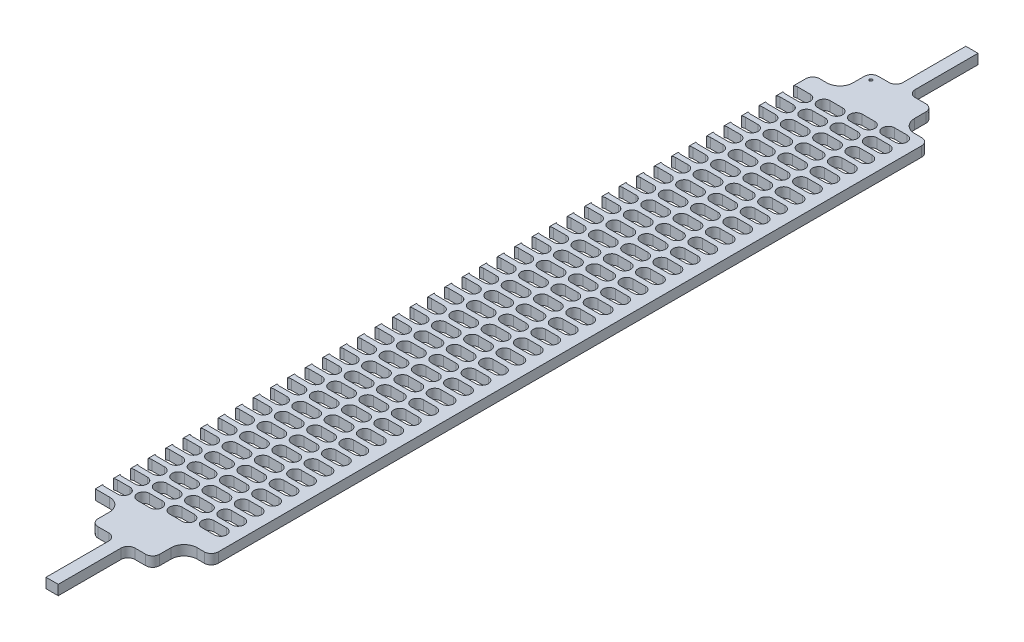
from build123d import *

# Parameters (mm, degrees)
SALIENTE_EXTRUIR1_DEPTH = 5.7
REDONDEO1_R             = 7.5
REDONDEO2_R             = 4
CROQUIS2_R              = 0.851014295
CORTAR_EXTRUIR1_DEPTH   = 1


with BuildPart() as part:
    # Croquis1 → Saliente-Extruir1 (new body)
    with BuildSketch(Plane(origin=(0, 0, 0), x_dir=(1, 0, 0), z_dir=(0, 1, 0))):
        with BuildLine():
            Line((15.6, 411.2), (15.6, 429.2))
            Line((15.6, 429.2), (29.75, 429.2))
            Line((29.75, 429.2), (29.75, 469.2))
            Line((29.75, 469.2), (36.75, 469.2))
            Line((36.75, 469.2), (36.75, 429.2))
            Line((36.75, 429.2), (50.9, 429.2))
            Line((50.9, 429.2), (50.9, 411.2))
            Line((50.9, 411.2), (66.5, 411.2))
            Line((66.5, 411.2), (66.5, 0))
            Line((66.5, 0), (50.9, 0))
            Line((50.9, 0), (50.9, -18))
            Line((50.9, -18), (36.75, -18))
            Line((36.75, -18), (36.75, -58))
            Line((36.75, -58), (29.75, -58))
            Line((29.75, -58), (29.75, -18))
            Line((29.75, -18), (15.6, -18))
            Line((15.6, -18), (15.6, 0))
            Line((15.6, 0), (0, 0))
            Line((0, 0), (0, 4.298333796))
            ThreePointArc((0, 4.298333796), (0.866145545, 3.926883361), (1.8, 3.8))
            Line((1.8, 3.8), (9, 3.8))
            ThreePointArc((9, 3.8), (12.5, 7.3), (9, 10.8))
            Line((9, 10.8), (1.8, 10.8))
            ThreePointArc((1.8, 10.8), (0.866145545, 10.673116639), (0, 10.301666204))
            Line((0, 10.301666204), (0, 14.298333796))
            ThreePointArc((0, 14.298333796), (0.866145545, 13.926883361), (1.8, 13.8))
            Line((1.8, 13.8), (9, 13.8))
            ThreePointArc((9, 13.8), (12.5, 17.3), (9, 20.8))
            Line((9, 20.8), (1.8, 20.8))
            ThreePointArc((1.8, 20.8), (0.866145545, 20.673116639), (0, 20.301666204))
            Line((0, 20.301666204), (0, 24.298333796))
            ThreePointArc((0, 24.298333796), (0.866145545, 23.926883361), (1.8, 23.8))
            Line((1.8, 23.8), (9, 23.8))
            ThreePointArc((9, 23.8), (12.5, 27.3), (9, 30.8))
            Line((9, 30.8), (1.8, 30.8))
            ThreePointArc((1.8, 30.8), (0.866145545, 30.673116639), (0, 30.301666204))
            Line((0, 30.301666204), (0, 34.298333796))
            ThreePointArc((0, 34.298333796), (0.866145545, 33.926883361), (1.8, 33.8))
            Line((1.8, 33.8), (9, 33.8))
            ThreePointArc((9, 33.8), (12.5, 37.3), (9, 40.8))
            Line((9, 40.8), (1.8, 40.8))
            ThreePointArc((1.8, 40.8), (0.866145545, 40.673116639), (0, 40.301666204))
            Line((0, 40.301666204), (0, 44.298333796))
            ThreePointArc((0, 44.298333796), (0.866145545, 43.926883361), (1.8, 43.8))
            Line((1.8, 43.8), (9, 43.8))
            ThreePointArc((9, 43.8), (12.5, 47.3), (9, 50.8))
            Line((9, 50.8), (1.8, 50.8))
            ThreePointArc((1.8, 50.8), (0.866145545, 50.673116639), (0, 50.301666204))
            Line((0, 50.301666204), (0, 54.298333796))
            ThreePointArc((0, 54.298333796), (0.866145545, 53.926883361), (1.8, 53.8))
            Line((1.8, 53.8), (9, 53.8))
            ThreePointArc((9, 53.8), (12.5, 57.3), (9, 60.8))
            Line((9, 60.8), (1.8, 60.8))
            ThreePointArc((1.8, 60.8), (0.866145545, 60.673116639), (0, 60.301666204))
            Line((0, 60.301666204), (0, 64.298333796))
            ThreePointArc((0, 64.298333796), (0.866145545, 63.926883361), (1.8, 63.8))
            Line((1.8, 63.8), (9, 63.8))
            ThreePointArc((9, 63.8), (12.5, 67.3), (9, 70.8))
            Line((9, 70.8), (1.8, 70.8))
            ThreePointArc((1.8, 70.8), (0.866145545, 70.673116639), (0, 70.301666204))
            Line((0, 70.301666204), (0, 74.298333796))
            ThreePointArc((0, 74.298333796), (0.866145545, 73.926883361), (1.8, 73.8))
            Line((1.8, 73.8), (9, 73.8))
            ThreePointArc((9, 73.8), (12.5, 77.3), (9, 80.8))
            Line((9, 80.8), (1.8, 80.8))
            ThreePointArc((1.8, 80.8), (0.866145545, 80.673116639), (0, 80.301666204))
            Line((0, 80.301666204), (0, 84.298333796))
            ThreePointArc((0, 84.298333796), (0.866145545, 83.926883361), (1.8, 83.8))
            Line((1.8, 83.8), (9, 83.8))
            ThreePointArc((9, 83.8), (12.5, 87.3), (9, 90.8))
            Line((9, 90.8), (1.8, 90.8))
            ThreePointArc((1.8, 90.8), (0.866145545, 90.673116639), (0, 90.301666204))
            Line((0, 90.301666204), (0, 94.298333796))
            ThreePointArc((0, 94.298333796), (0.866145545, 93.926883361), (1.8, 93.8))
            Line((1.8, 93.8), (9, 93.8))
            ThreePointArc((9, 93.8), (12.5, 97.3), (9, 100.8))
            Line((9, 100.8), (1.8, 100.8))
            ThreePointArc((1.8, 100.8), (0.866145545, 100.673116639), (0, 100.301666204))
            Line((0, 100.301666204), (0, 104.298333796))
            ThreePointArc((0, 104.298333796), (0.866145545, 103.926883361), (1.8, 103.8))
            Line((1.8, 103.8), (9, 103.8))
            ThreePointArc((9, 103.8), (12.5, 107.3), (9, 110.8))
            Line((9, 110.8), (1.8, 110.8))
            ThreePointArc((1.8, 110.8), (0.866145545, 110.673116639), (0, 110.301666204))
            Line((0, 110.301666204), (0, 114.298333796))
            ThreePointArc((0, 114.298333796), (0.866145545, 113.926883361), (1.8, 113.8))
            Line((1.8, 113.8), (9, 113.8))
            ThreePointArc((9, 113.8), (12.5, 117.3), (9, 120.8))
            Line((9, 120.8), (1.8, 120.8))
            ThreePointArc((1.8, 120.8), (0.866145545, 120.673116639), (0, 120.301666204))
            Line((0, 120.301666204), (0, 124.298333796))
            ThreePointArc((0, 124.298333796), (0.866145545, 123.926883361), (1.8, 123.8))
            Line((1.8, 123.8), (9, 123.8))
            ThreePointArc((9, 123.8), (12.5, 127.3), (9, 130.8))
            Line((9, 130.8), (1.8, 130.8))
            ThreePointArc((1.8, 130.8), (0.866145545, 130.673116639), (0, 130.301666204))
            Line((0, 130.301666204), (0, 134.298333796))
            ThreePointArc((0, 134.298333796), (0.866145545, 133.926883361), (1.8, 133.8))
            Line((1.8, 133.8), (9, 133.8))
            ThreePointArc((9, 133.8), (12.5, 137.3), (9, 140.8))
            Line((9, 140.8), (1.8, 140.8))
            ThreePointArc((1.8, 140.8), (0.866145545, 140.673116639), (0, 140.301666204))
            Line((0, 140.301666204), (0, 144.298333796))
            ThreePointArc((0, 144.298333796), (0.866145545, 143.926883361), (1.8, 143.8))
            Line((1.8, 143.8), (9, 143.8))
            ThreePointArc((9, 143.8), (12.5, 147.3), (9, 150.8))
            Line((9, 150.8), (1.8, 150.8))
            ThreePointArc((1.8, 150.8), (0.866145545, 150.673116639), (0, 150.301666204))
            Line((0, 150.301666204), (0, 154.298333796))
            ThreePointArc((0, 154.298333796), (0.866145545, 153.926883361), (1.8, 153.8))
            Line((1.8, 153.8), (9, 153.8))
            ThreePointArc((9, 153.8), (12.5, 157.3), (9, 160.8))
            Line((9, 160.8), (1.8, 160.8))
            ThreePointArc((1.8, 160.8), (0.866145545, 160.673116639), (0, 160.301666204))
            Line((0, 160.301666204), (0, 164.298333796))
            ThreePointArc((0, 164.298333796), (0.866145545, 163.926883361), (1.8, 163.8))
            Line((1.8, 163.8), (9, 163.8))
            ThreePointArc((9, 163.8), (12.5, 167.3), (9, 170.8))
            Line((9, 170.8), (1.8, 170.8))
            ThreePointArc((1.8, 170.8), (0.866145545, 170.673116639), (0, 170.301666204))
            Line((0, 170.301666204), (0, 174.298333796))
            ThreePointArc((0, 174.298333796), (0.866145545, 173.926883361), (1.8, 173.8))
            Line((1.8, 173.8), (9, 173.8))
            ThreePointArc((9, 173.8), (12.5, 177.3), (9, 180.8))
            Line((9, 180.8), (1.8, 180.8))
            ThreePointArc((1.8, 180.8), (0.866145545, 180.673116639), (0, 180.301666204))
            Line((0, 180.301666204), (0, 184.298333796))
            ThreePointArc((0, 184.298333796), (0.866145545, 183.926883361), (1.8, 183.8))
            Line((1.8, 183.8), (9, 183.8))
            ThreePointArc((9, 183.8), (12.5, 187.3), (9, 190.8))
            Line((9, 190.8), (1.8, 190.8))
            ThreePointArc((1.8, 190.8), (0.866145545, 190.673116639), (0, 190.301666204))
            Line((0, 190.301666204), (0, 194.298333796))
            ThreePointArc((0, 194.298333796), (0.866145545, 193.926883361), (1.8, 193.8))
            Line((1.8, 193.8), (9, 193.8))
            ThreePointArc((9, 193.8), (12.5, 197.3), (9, 200.8))
            Line((9, 200.8), (1.8, 200.8))
            ThreePointArc((1.8, 200.8), (0.866145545, 200.673116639), (0, 200.301666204))
            Line((0, 200.301666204), (0, 204.298333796))
            ThreePointArc((0, 204.298333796), (0.866145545, 203.926883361), (1.8, 203.8))
            Line((1.8, 203.8), (9, 203.8))
            ThreePointArc((9, 203.8), (12.5, 207.3), (9, 210.8))
            Line((9, 210.8), (1.8, 210.8))
            ThreePointArc((1.8, 210.8), (0.866145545, 210.673116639), (0, 210.301666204))
            Line((0, 210.301666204), (0, 214.298333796))
            ThreePointArc((0, 214.298333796), (0.866145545, 213.926883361), (1.8, 213.8))
            Line((1.8, 213.8), (9, 213.8))
            ThreePointArc((9, 213.8), (12.5, 217.3), (9, 220.8))
            Line((9, 220.8), (1.8, 220.8))
            ThreePointArc((1.8, 220.8), (0.866145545, 220.673116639), (0, 220.301666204))
            Line((0, 220.301666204), (0, 224.298333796))
            ThreePointArc((0, 224.298333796), (0.866145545, 223.926883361), (1.8, 223.8))
            Line((1.8, 223.8), (9, 223.8))
            ThreePointArc((9, 223.8), (12.5, 227.3), (9, 230.8))
            Line((9, 230.8), (1.8, 230.8))
            ThreePointArc((1.8, 230.8), (0.866145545, 230.673116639), (0, 230.301666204))
            Line((0, 230.301666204), (0, 234.298333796))
            ThreePointArc((0, 234.298333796), (0.866145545, 233.926883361), (1.8, 233.8))
            Line((1.8, 233.8), (9, 233.8))
            ThreePointArc((9, 233.8), (12.5, 237.3), (9, 240.8))
            Line((9, 240.8), (1.8, 240.8))
            ThreePointArc((1.8, 240.8), (0.866145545, 240.673116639), (0, 240.301666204))
            Line((0, 240.301666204), (0, 244.298333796))
            ThreePointArc((0, 244.298333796), (0.866145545, 243.926883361), (1.8, 243.8))
            Line((1.8, 243.8), (9, 243.8))
            ThreePointArc((9, 243.8), (12.5, 247.3), (9, 250.8))
            Line((9, 250.8), (1.8, 250.8))
            ThreePointArc((1.8, 250.8), (0.866145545, 250.673116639), (0, 250.301666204))
            Line((0, 250.301666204), (0, 254.298333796))
            ThreePointArc((0, 254.298333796), (0.866145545, 253.926883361), (1.8, 253.8))
            Line((1.8, 253.8), (9, 253.8))
            ThreePointArc((9, 253.8), (12.5, 257.3), (9, 260.8))
            Line((9, 260.8), (1.8, 260.8))
            ThreePointArc((1.8, 260.8), (0.866145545, 260.673116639), (0, 260.301666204))
            Line((0, 260.301666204), (0, 264.298333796))
            ThreePointArc((0, 264.298333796), (0.866145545, 263.926883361), (1.8, 263.8))
            Line((1.8, 263.8), (9, 263.8))
            ThreePointArc((9, 263.8), (12.5, 267.3), (9, 270.8))
            Line((9, 270.8), (1.8, 270.8))
            ThreePointArc((1.8, 270.8), (0.866145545, 270.673116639), (0, 270.301666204))
            Line((0, 270.301666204), (0, 274.298333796))
            ThreePointArc((0, 274.298333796), (0.866145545, 273.926883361), (1.8, 273.8))
            Line((1.8, 273.8), (9, 273.8))
            ThreePointArc((9, 273.8), (12.5, 277.3), (9, 280.8))
            Line((9, 280.8), (1.8, 280.8))
            ThreePointArc((1.8, 280.8), (0.866145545, 280.673116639), (0, 280.301666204))
            Line((0, 280.301666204), (0, 284.298333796))
            ThreePointArc((0, 284.298333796), (0.866145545, 283.926883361), (1.8, 283.8))
            Line((1.8, 283.8), (9, 283.8))
            ThreePointArc((9, 283.8), (12.5, 287.3), (9, 290.8))
            Line((9, 290.8), (1.8, 290.8))
            ThreePointArc((1.8, 290.8), (0.866145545, 290.673116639), (0, 290.301666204))
            Line((0, 290.301666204), (0, 294.298333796))
            ThreePointArc((0, 294.298333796), (0.866145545, 293.926883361), (1.8, 293.8))
            Line((1.8, 293.8), (9, 293.8))
            ThreePointArc((9, 293.8), (12.5, 297.3), (9, 300.8))
            Line((9, 300.8), (1.8, 300.8))
            ThreePointArc((1.8, 300.8), (0.866145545, 300.673116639), (0, 300.301666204))
            Line((0, 300.301666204), (0, 304.298333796))
            ThreePointArc((0, 304.298333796), (0.866145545, 303.926883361), (1.8, 303.8))
            Line((1.8, 303.8), (9, 303.8))
            ThreePointArc((9, 303.8), (12.5, 307.3), (9, 310.8))
            Line((9, 310.8), (1.8, 310.8))
            ThreePointArc((1.8, 310.8), (0.866145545, 310.673116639), (0, 310.301666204))
            Line((0, 310.301666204), (0, 314.298333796))
            ThreePointArc((0, 314.298333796), (0.866145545, 313.926883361), (1.8, 313.8))
            Line((1.8, 313.8), (9, 313.8))
            ThreePointArc((9, 313.8), (12.5, 317.3), (9, 320.8))
            Line((9, 320.8), (1.8, 320.8))
            ThreePointArc((1.8, 320.8), (0.866145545, 320.673116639), (0, 320.301666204))
            Line((0, 320.301666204), (0, 324.298333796))
            ThreePointArc((0, 324.298333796), (0.866145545, 323.926883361), (1.8, 323.8))
            Line((1.8, 323.8), (9, 323.8))
            ThreePointArc((9, 323.8), (12.5, 327.3), (9, 330.8))
            Line((9, 330.8), (1.8, 330.8))
            ThreePointArc((1.8, 330.8), (0.866145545, 330.673116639), (0, 330.301666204))
            Line((0, 330.301666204), (0, 334.298333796))
            ThreePointArc((0, 334.298333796), (0.866145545, 333.926883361), (1.8, 333.8))
            Line((1.8, 333.8), (9, 333.8))
            ThreePointArc((9, 333.8), (12.5, 337.3), (9, 340.8))
            Line((9, 340.8), (1.8, 340.8))
            ThreePointArc((1.8, 340.8), (0.866145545, 340.673116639), (0, 340.301666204))
            Line((0, 340.301666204), (0, 344.298333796))
            ThreePointArc((0, 344.298333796), (0.866145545, 343.926883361), (1.8, 343.8))
            Line((1.8, 343.8), (9, 343.8))
            ThreePointArc((9, 343.8), (12.5, 347.3), (9, 350.8))
            Line((9, 350.8), (1.8, 350.8))
            ThreePointArc((1.8, 350.8), (0.866145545, 350.673116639), (0, 350.301666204))
            Line((0, 350.301666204), (0, 354.298333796))
            ThreePointArc((0, 354.298333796), (0.866145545, 353.926883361), (1.8, 353.8))
            Line((1.8, 353.8), (9, 353.8))
            ThreePointArc((9, 353.8), (12.5, 357.3), (9, 360.8))
            Line((9, 360.8), (1.8, 360.8))
            ThreePointArc((1.8, 360.8), (0.866145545, 360.673116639), (0, 360.301666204))
            Line((0, 360.301666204), (0, 364.298333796))
            ThreePointArc((0, 364.298333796), (0.866145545, 363.926883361), (1.8, 363.8))
            Line((1.8, 363.8), (9, 363.8))
            ThreePointArc((9, 363.8), (12.5, 367.3), (9, 370.8))
            Line((9, 370.8), (1.8, 370.8))
            ThreePointArc((1.8, 370.8), (0.866145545, 370.673116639), (0, 370.301666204))
            Line((0, 370.301666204), (0, 374.298333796))
            ThreePointArc((0, 374.298333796), (0.866145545, 373.926883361), (1.8, 373.8))
            Line((1.8, 373.8), (9, 373.8))
            ThreePointArc((9, 373.8), (12.5, 377.3), (9, 380.8))
            Line((9, 380.8), (1.8, 380.8))
            ThreePointArc((1.8, 380.8), (0.866145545, 380.673116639), (0, 380.301666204))
            Line((0, 380.301666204), (0, 384.298333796))
            ThreePointArc((0, 384.298333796), (0.866145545, 383.926883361), (1.8, 383.8))
            Line((1.8, 383.8), (9, 383.8))
            ThreePointArc((9, 383.8), (12.5, 387.3), (9, 390.8))
            Line((9, 390.8), (1.8, 390.8))
            ThreePointArc((1.8, 390.8), (0.866145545, 390.673116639), (0, 390.301666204))
            Line((0, 390.301666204), (0, 394.298333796))
            ThreePointArc((0, 394.298333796), (0.866145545, 393.926883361), (1.8, 393.8))
            Line((1.8, 393.8), (9, 393.8))
            ThreePointArc((9, 393.8), (12.5, 397.3), (9, 400.8))
            Line((9, 400.8), (1.8, 400.8))
            ThreePointArc((1.8, 400.8), (0.866145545, 400.673116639), (0, 400.301666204))
            Line((0, 400.301666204), (0, 411.2))
            Line((0, 411.2), (15.6, 411.2))
        make_face()
        with BuildLine():
            Line((49.8, 408.3), (57, 408.3))
            ThreePointArc((57, 408.3), (60.5, 404.8), (57, 401.3))
            Line((57, 401.3), (49.8, 401.3))
            ThreePointArc((49.8, 401.3), (46.3, 404.8), (49.8, 408.3))
        make_face(mode=Mode.SUBTRACT)
        with BuildLine():
            Line((33.8, 398.8), (41, 398.8))
            ThreePointArc((41, 398.8), (44.5, 402.3), (41, 405.8))
            Line((41, 405.8), (33.8, 405.8))
            ThreePointArc((33.8, 405.8), (30.3, 402.3), (33.8, 398.8))
        make_face(mode=Mode.SUBTRACT)
        with BuildLine():
            Line((17.8, 396.3), (25, 396.3))
            ThreePointArc((25, 396.3), (28.5, 399.8), (25, 403.3))
            Line((25, 403.3), (17.8, 403.3))
            ThreePointArc((17.8, 403.3), (14.3, 399.8), (17.8, 396.3))
        make_face(mode=Mode.SUBTRACT)
        with BuildLine():
            Line((49.8, 398.3), (57, 398.3))
            ThreePointArc((57, 398.3), (60.5, 394.8), (57, 391.3))
            Line((57, 391.3), (49.8, 391.3))
            ThreePointArc((49.8, 391.3), (46.3, 394.8), (49.8, 398.3))
        make_face(mode=Mode.SUBTRACT)
        with BuildLine():
            Line((33.8, 395.8), (41, 395.8))
            ThreePointArc((41, 395.8), (44.5, 392.3), (41, 388.8))
            Line((41, 388.8), (33.8, 388.8))
            ThreePointArc((33.8, 388.8), (30.3, 392.3), (33.8, 395.8))
        make_face(mode=Mode.SUBTRACT)
        with BuildLine():
            Line((17.8, 393.3), (25, 393.3))
            ThreePointArc((25, 393.3), (28.5, 389.8), (25, 386.3))
            Line((25, 386.3), (17.8, 386.3))
            ThreePointArc((17.8, 386.3), (14.3, 389.8), (17.8, 393.3))
        make_face(mode=Mode.SUBTRACT)
        with BuildLine():
            Line((49.8, 388.3), (57, 388.3))
            ThreePointArc((57, 388.3), (60.5, 384.8), (57, 381.3))
            Line((57, 381.3), (49.8, 381.3))
            ThreePointArc((49.8, 381.3), (46.3, 384.8), (49.8, 388.3))
        make_face(mode=Mode.SUBTRACT)
        with BuildLine():
            Line((33.8, 385.8), (41, 385.8))
            ThreePointArc((41, 385.8), (44.5, 382.3), (41, 378.8))
            Line((41, 378.8), (33.8, 378.8))
            ThreePointArc((33.8, 378.8), (30.3, 382.3), (33.8, 385.8))
        make_face(mode=Mode.SUBTRACT)
        with BuildLine():
            Line((17.8, 383.3), (25, 383.3))
            ThreePointArc((25, 383.3), (28.5, 379.8), (25, 376.3))
            Line((25, 376.3), (17.8, 376.3))
            ThreePointArc((17.8, 376.3), (14.3, 379.8), (17.8, 383.3))
        make_face(mode=Mode.SUBTRACT)
        with BuildLine():
            Line((49.8, 378.3), (57, 378.3))
            ThreePointArc((57, 378.3), (60.5, 374.8), (57, 371.3))
            Line((57, 371.3), (49.8, 371.3))
            ThreePointArc((49.8, 371.3), (46.3, 374.8), (49.8, 378.3))
        make_face(mode=Mode.SUBTRACT)
        with BuildLine():
            Line((33.8, 375.8), (41, 375.8))
            ThreePointArc((41, 375.8), (44.5, 372.3), (41, 368.8))
            Line((41, 368.8), (33.8, 368.8))
            ThreePointArc((33.8, 368.8), (30.3, 372.3), (33.8, 375.8))
        make_face(mode=Mode.SUBTRACT)
        with BuildLine():
            Line((17.8, 373.3), (25, 373.3))
            ThreePointArc((25, 373.3), (28.5, 369.8), (25, 366.3))
            Line((25, 366.3), (17.8, 366.3))
            ThreePointArc((17.8, 366.3), (14.3, 369.8), (17.8, 373.3))
        make_face(mode=Mode.SUBTRACT)
        with BuildLine():
            Line((49.8, 368.3), (57, 368.3))
            ThreePointArc((57, 368.3), (60.5, 364.8), (57, 361.3))
            Line((57, 361.3), (49.8, 361.3))
            ThreePointArc((49.8, 361.3), (46.3, 364.8), (49.8, 368.3))
        make_face(mode=Mode.SUBTRACT)
        with BuildLine():
            Line((33.8, 365.8), (41, 365.8))
            ThreePointArc((41, 365.8), (44.5, 362.3), (41, 358.8))
            Line((41, 358.8), (33.8, 358.8))
            ThreePointArc((33.8, 358.8), (30.3, 362.3), (33.8, 365.8))
        make_face(mode=Mode.SUBTRACT)
        with BuildLine():
            Line((17.8, 363.3), (25, 363.3))
            ThreePointArc((25, 363.3), (28.5, 359.8), (25, 356.3))
            Line((25, 356.3), (17.8, 356.3))
            ThreePointArc((17.8, 356.3), (14.3, 359.8), (17.8, 363.3))
        make_face(mode=Mode.SUBTRACT)
        with BuildLine():
            Line((49.8, 358.3), (57, 358.3))
            ThreePointArc((57, 358.3), (60.5, 354.8), (57, 351.3))
            Line((57, 351.3), (49.8, 351.3))
            ThreePointArc((49.8, 351.3), (46.3, 354.8), (49.8, 358.3))
        make_face(mode=Mode.SUBTRACT)
        with BuildLine():
            Line((33.8, 355.8), (41, 355.8))
            ThreePointArc((41, 355.8), (44.5, 352.3), (41, 348.8))
            Line((41, 348.8), (33.8, 348.8))
            ThreePointArc((33.8, 348.8), (30.3, 352.3), (33.8, 355.8))
        make_face(mode=Mode.SUBTRACT)
        with BuildLine():
            Line((17.8, 353.3), (25, 353.3))
            ThreePointArc((25, 353.3), (28.5, 349.8), (25, 346.3))
            Line((25, 346.3), (17.8, 346.3))
            ThreePointArc((17.8, 346.3), (14.3, 349.8), (17.8, 353.3))
        make_face(mode=Mode.SUBTRACT)
        with BuildLine():
            Line((49.8, 348.3), (57, 348.3))
            ThreePointArc((57, 348.3), (60.5, 344.8), (57, 341.3))
            Line((57, 341.3), (49.8, 341.3))
            ThreePointArc((49.8, 341.3), (46.3, 344.8), (49.8, 348.3))
        make_face(mode=Mode.SUBTRACT)
        with BuildLine():
            Line((33.8, 345.8), (41, 345.8))
            ThreePointArc((41, 345.8), (44.5, 342.3), (41, 338.8))
            Line((41, 338.8), (33.8, 338.8))
            ThreePointArc((33.8, 338.8), (30.3, 342.3), (33.8, 345.8))
        make_face(mode=Mode.SUBTRACT)
        with BuildLine():
            Line((17.8, 343.3), (25, 343.3))
            ThreePointArc((25, 343.3), (28.5, 339.8), (25, 336.3))
            Line((25, 336.3), (17.8, 336.3))
            ThreePointArc((17.8, 336.3), (14.3, 339.8), (17.8, 343.3))
        make_face(mode=Mode.SUBTRACT)
        with BuildLine():
            Line((49.8, 338.3), (57, 338.3))
            ThreePointArc((57, 338.3), (60.5, 334.8), (57, 331.3))
            Line((57, 331.3), (49.8, 331.3))
            ThreePointArc((49.8, 331.3), (46.3, 334.8), (49.8, 338.3))
        make_face(mode=Mode.SUBTRACT)
        with BuildLine():
            Line((33.8, 335.8), (41, 335.8))
            ThreePointArc((41, 335.8), (44.5, 332.3), (41, 328.8))
            Line((41, 328.8), (33.8, 328.8))
            ThreePointArc((33.8, 328.8), (30.3, 332.3), (33.8, 335.8))
        make_face(mode=Mode.SUBTRACT)
        with BuildLine():
            Line((17.8, 333.3), (25, 333.3))
            ThreePointArc((25, 333.3), (28.5, 329.8), (25, 326.3))
            Line((25, 326.3), (17.8, 326.3))
            ThreePointArc((17.8, 326.3), (14.3, 329.8), (17.8, 333.3))
        make_face(mode=Mode.SUBTRACT)
        with BuildLine():
            Line((49.8, 328.3), (57, 328.3))
            ThreePointArc((57, 328.3), (60.5, 324.8), (57, 321.3))
            Line((57, 321.3), (49.8, 321.3))
            ThreePointArc((49.8, 321.3), (46.3, 324.8), (49.8, 328.3))
        make_face(mode=Mode.SUBTRACT)
        with BuildLine():
            Line((33.8, 325.8), (41, 325.8))
            ThreePointArc((41, 325.8), (44.5, 322.3), (41, 318.8))
            Line((41, 318.8), (33.8, 318.8))
            ThreePointArc((33.8, 318.8), (30.3, 322.3), (33.8, 325.8))
        make_face(mode=Mode.SUBTRACT)
        with BuildLine():
            Line((17.8, 323.3), (25, 323.3))
            ThreePointArc((25, 323.3), (28.5, 319.8), (25, 316.3))
            Line((25, 316.3), (17.8, 316.3))
            ThreePointArc((17.8, 316.3), (14.3, 319.8), (17.8, 323.3))
        make_face(mode=Mode.SUBTRACT)
        with BuildLine():
            Line((49.8, 318.3), (57, 318.3))
            ThreePointArc((57, 318.3), (60.5, 314.8), (57, 311.3))
            Line((57, 311.3), (49.8, 311.3))
            ThreePointArc((49.8, 311.3), (46.3, 314.8), (49.8, 318.3))
        make_face(mode=Mode.SUBTRACT)
        with BuildLine():
            Line((33.8, 315.8), (41, 315.8))
            ThreePointArc((41, 315.8), (44.5, 312.3), (41, 308.8))
            Line((41, 308.8), (33.8, 308.8))
            ThreePointArc((33.8, 308.8), (30.3, 312.3), (33.8, 315.8))
        make_face(mode=Mode.SUBTRACT)
        with BuildLine():
            Line((17.8, 313.3), (25, 313.3))
            ThreePointArc((25, 313.3), (28.5, 309.8), (25, 306.3))
            Line((25, 306.3), (17.8, 306.3))
            ThreePointArc((17.8, 306.3), (14.3, 309.8), (17.8, 313.3))
        make_face(mode=Mode.SUBTRACT)
        with BuildLine():
            Line((49.8, 308.3), (57, 308.3))
            ThreePointArc((57, 308.3), (60.5, 304.8), (57, 301.3))
            Line((57, 301.3), (49.8, 301.3))
            ThreePointArc((49.8, 301.3), (46.3, 304.8), (49.8, 308.3))
        make_face(mode=Mode.SUBTRACT)
        with BuildLine():
            Line((33.8, 305.8), (41, 305.8))
            ThreePointArc((41, 305.8), (44.5, 302.3), (41, 298.8))
            Line((41, 298.8), (33.8, 298.8))
            ThreePointArc((33.8, 298.8), (30.3, 302.3), (33.8, 305.8))
        make_face(mode=Mode.SUBTRACT)
        with BuildLine():
            Line((17.8, 303.3), (25, 303.3))
            ThreePointArc((25, 303.3), (28.5, 299.8), (25, 296.3))
            Line((25, 296.3), (17.8, 296.3))
            ThreePointArc((17.8, 296.3), (14.3, 299.8), (17.8, 303.3))
        make_face(mode=Mode.SUBTRACT)
        with BuildLine():
            Line((49.8, 298.3), (57, 298.3))
            ThreePointArc((57, 298.3), (60.5, 294.8), (57, 291.3))
            Line((57, 291.3), (49.8, 291.3))
            ThreePointArc((49.8, 291.3), (46.3, 294.8), (49.8, 298.3))
        make_face(mode=Mode.SUBTRACT)
        with BuildLine():
            Line((33.8, 295.8), (41, 295.8))
            ThreePointArc((41, 295.8), (44.5, 292.3), (41, 288.8))
            Line((41, 288.8), (33.8, 288.8))
            ThreePointArc((33.8, 288.8), (30.3, 292.3), (33.8, 295.8))
        make_face(mode=Mode.SUBTRACT)
        with BuildLine():
            Line((17.8, 293.3), (25, 293.3))
            ThreePointArc((25, 293.3), (28.5, 289.8), (25, 286.3))
            Line((25, 286.3), (17.8, 286.3))
            ThreePointArc((17.8, 286.3), (14.3, 289.8), (17.8, 293.3))
        make_face(mode=Mode.SUBTRACT)
        with BuildLine():
            Line((49.8, 288.3), (57, 288.3))
            ThreePointArc((57, 288.3), (60.5, 284.8), (57, 281.3))
            Line((57, 281.3), (49.8, 281.3))
            ThreePointArc((49.8, 281.3), (46.3, 284.8), (49.8, 288.3))
        make_face(mode=Mode.SUBTRACT)
        with BuildLine():
            Line((33.8, 285.8), (41, 285.8))
            ThreePointArc((41, 285.8), (44.5, 282.3), (41, 278.8))
            Line((41, 278.8), (33.8, 278.8))
            ThreePointArc((33.8, 278.8), (30.3, 282.3), (33.8, 285.8))
        make_face(mode=Mode.SUBTRACT)
        with BuildLine():
            Line((17.8, 283.3), (25, 283.3))
            ThreePointArc((25, 283.3), (28.5, 279.8), (25, 276.3))
            Line((25, 276.3), (17.8, 276.3))
            ThreePointArc((17.8, 276.3), (14.3, 279.8), (17.8, 283.3))
        make_face(mode=Mode.SUBTRACT)
        with BuildLine():
            Line((49.8, 278.3), (57, 278.3))
            ThreePointArc((57, 278.3), (60.5, 274.8), (57, 271.3))
            Line((57, 271.3), (49.8, 271.3))
            ThreePointArc((49.8, 271.3), (46.3, 274.8), (49.8, 278.3))
        make_face(mode=Mode.SUBTRACT)
        with BuildLine():
            Line((33.8, 275.8), (41, 275.8))
            ThreePointArc((41, 275.8), (44.5, 272.3), (41, 268.8))
            Line((41, 268.8), (33.8, 268.8))
            ThreePointArc((33.8, 268.8), (30.3, 272.3), (33.8, 275.8))
        make_face(mode=Mode.SUBTRACT)
        with BuildLine():
            Line((17.8, 273.3), (25, 273.3))
            ThreePointArc((25, 273.3), (28.5, 269.8), (25, 266.3))
            Line((25, 266.3), (17.8, 266.3))
            ThreePointArc((17.8, 266.3), (14.3, 269.8), (17.8, 273.3))
        make_face(mode=Mode.SUBTRACT)
        with BuildLine():
            Line((49.8, 268.3), (57, 268.3))
            ThreePointArc((57, 268.3), (60.5, 264.8), (57, 261.3))
            Line((57, 261.3), (49.8, 261.3))
            ThreePointArc((49.8, 261.3), (46.3, 264.8), (49.8, 268.3))
        make_face(mode=Mode.SUBTRACT)
        with BuildLine():
            Line((33.8, 265.8), (41, 265.8))
            ThreePointArc((41, 265.8), (44.5, 262.3), (41, 258.8))
            Line((41, 258.8), (33.8, 258.8))
            ThreePointArc((33.8, 258.8), (30.3, 262.3), (33.8, 265.8))
        make_face(mode=Mode.SUBTRACT)
        with BuildLine():
            Line((17.8, 263.3), (25, 263.3))
            ThreePointArc((25, 263.3), (28.5, 259.8), (25, 256.3))
            Line((25, 256.3), (17.8, 256.3))
            ThreePointArc((17.8, 256.3), (14.3, 259.8), (17.8, 263.3))
        make_face(mode=Mode.SUBTRACT)
        with BuildLine():
            Line((49.8, 258.3), (57, 258.3))
            ThreePointArc((57, 258.3), (60.5, 254.8), (57, 251.3))
            Line((57, 251.3), (49.8, 251.3))
            ThreePointArc((49.8, 251.3), (46.3, 254.8), (49.8, 258.3))
        make_face(mode=Mode.SUBTRACT)
        with BuildLine():
            Line((33.8, 255.8), (41, 255.8))
            ThreePointArc((41, 255.8), (44.5, 252.3), (41, 248.8))
            Line((41, 248.8), (33.8, 248.8))
            ThreePointArc((33.8, 248.8), (30.3, 252.3), (33.8, 255.8))
        make_face(mode=Mode.SUBTRACT)
        with BuildLine():
            Line((17.8, 253.3), (25, 253.3))
            ThreePointArc((25, 253.3), (28.5, 249.8), (25, 246.3))
            Line((25, 246.3), (17.8, 246.3))
            ThreePointArc((17.8, 246.3), (14.3, 249.8), (17.8, 253.3))
        make_face(mode=Mode.SUBTRACT)
        with BuildLine():
            Line((49.8, 248.3), (57, 248.3))
            ThreePointArc((57, 248.3), (60.5, 244.8), (57, 241.3))
            Line((57, 241.3), (49.8, 241.3))
            ThreePointArc((49.8, 241.3), (46.3, 244.8), (49.8, 248.3))
        make_face(mode=Mode.SUBTRACT)
        with BuildLine():
            Line((33.8, 245.8), (41, 245.8))
            ThreePointArc((41, 245.8), (44.5, 242.3), (41, 238.8))
            Line((41, 238.8), (33.8, 238.8))
            ThreePointArc((33.8, 238.8), (30.3, 242.3), (33.8, 245.8))
        make_face(mode=Mode.SUBTRACT)
        with BuildLine():
            Line((17.8, 243.3), (25, 243.3))
            ThreePointArc((25, 243.3), (28.5, 239.8), (25, 236.3))
            Line((25, 236.3), (17.8, 236.3))
            ThreePointArc((17.8, 236.3), (14.3, 239.8), (17.8, 243.3))
        make_face(mode=Mode.SUBTRACT)
        with BuildLine():
            Line((49.8, 238.3), (57, 238.3))
            ThreePointArc((57, 238.3), (60.5, 234.8), (57, 231.3))
            Line((57, 231.3), (49.8, 231.3))
            ThreePointArc((49.8, 231.3), (46.3, 234.8), (49.8, 238.3))
        make_face(mode=Mode.SUBTRACT)
        with BuildLine():
            Line((33.8, 235.8), (41, 235.8))
            ThreePointArc((41, 235.8), (44.5, 232.3), (41, 228.8))
            Line((41, 228.8), (33.8, 228.8))
            ThreePointArc((33.8, 228.8), (30.3, 232.3), (33.8, 235.8))
        make_face(mode=Mode.SUBTRACT)
        with BuildLine():
            Line((17.8, 233.3), (25, 233.3))
            ThreePointArc((25, 233.3), (28.5, 229.8), (25, 226.3))
            Line((25, 226.3), (17.8, 226.3))
            ThreePointArc((17.8, 226.3), (14.3, 229.8), (17.8, 233.3))
        make_face(mode=Mode.SUBTRACT)
        with BuildLine():
            Line((49.8, 228.3), (57, 228.3))
            ThreePointArc((57, 228.3), (60.5, 224.8), (57, 221.3))
            Line((57, 221.3), (49.8, 221.3))
            ThreePointArc((49.8, 221.3), (46.3, 224.8), (49.8, 228.3))
        make_face(mode=Mode.SUBTRACT)
        with BuildLine():
            Line((33.8, 225.8), (41, 225.8))
            ThreePointArc((41, 225.8), (44.5, 222.3), (41, 218.8))
            Line((41, 218.8), (33.8, 218.8))
            ThreePointArc((33.8, 218.8), (30.3, 222.3), (33.8, 225.8))
        make_face(mode=Mode.SUBTRACT)
        with BuildLine():
            Line((17.8, 223.3), (25, 223.3))
            ThreePointArc((25, 223.3), (28.5, 219.8), (25, 216.3))
            Line((25, 216.3), (17.8, 216.3))
            ThreePointArc((17.8, 216.3), (14.3, 219.8), (17.8, 223.3))
        make_face(mode=Mode.SUBTRACT)
        with BuildLine():
            Line((49.8, 218.3), (57, 218.3))
            ThreePointArc((57, 218.3), (60.5, 214.8), (57, 211.3))
            Line((57, 211.3), (49.8, 211.3))
            ThreePointArc((49.8, 211.3), (46.3, 214.8), (49.8, 218.3))
        make_face(mode=Mode.SUBTRACT)
        with BuildLine():
            Line((33.8, 215.8), (41, 215.8))
            ThreePointArc((41, 215.8), (44.5, 212.3), (41, 208.8))
            Line((41, 208.8), (33.8, 208.8))
            ThreePointArc((33.8, 208.8), (30.3, 212.3), (33.8, 215.8))
        make_face(mode=Mode.SUBTRACT)
        with BuildLine():
            Line((17.8, 213.3), (25, 213.3))
            ThreePointArc((25, 213.3), (28.5, 209.8), (25, 206.3))
            Line((25, 206.3), (17.8, 206.3))
            ThreePointArc((17.8, 206.3), (14.3, 209.8), (17.8, 213.3))
        make_face(mode=Mode.SUBTRACT)
        with BuildLine():
            Line((49.8, 208.3), (57, 208.3))
            ThreePointArc((57, 208.3), (60.5, 204.8), (57, 201.3))
            Line((57, 201.3), (49.8, 201.3))
            ThreePointArc((49.8, 201.3), (46.3, 204.8), (49.8, 208.3))
        make_face(mode=Mode.SUBTRACT)
        with BuildLine():
            Line((33.8, 205.8), (41, 205.8))
            ThreePointArc((41, 205.8), (44.5, 202.3), (41, 198.8))
            Line((41, 198.8), (33.8, 198.8))
            ThreePointArc((33.8, 198.8), (30.3, 202.3), (33.8, 205.8))
        make_face(mode=Mode.SUBTRACT)
        with BuildLine():
            Line((17.8, 203.3), (25, 203.3))
            ThreePointArc((25, 203.3), (28.5, 199.8), (25, 196.3))
            Line((25, 196.3), (17.8, 196.3))
            ThreePointArc((17.8, 196.3), (14.3, 199.8), (17.8, 203.3))
        make_face(mode=Mode.SUBTRACT)
        with BuildLine():
            Line((49.8, 198.3), (57, 198.3))
            ThreePointArc((57, 198.3), (60.5, 194.8), (57, 191.3))
            Line((57, 191.3), (49.8, 191.3))
            ThreePointArc((49.8, 191.3), (46.3, 194.8), (49.8, 198.3))
        make_face(mode=Mode.SUBTRACT)
        with BuildLine():
            Line((33.8, 195.8), (41, 195.8))
            ThreePointArc((41, 195.8), (44.5, 192.3), (41, 188.8))
            Line((41, 188.8), (33.8, 188.8))
            ThreePointArc((33.8, 188.8), (30.3, 192.3), (33.8, 195.8))
        make_face(mode=Mode.SUBTRACT)
        with BuildLine():
            Line((17.8, 193.3), (25, 193.3))
            ThreePointArc((25, 193.3), (28.5, 189.8), (25, 186.3))
            Line((25, 186.3), (17.8, 186.3))
            ThreePointArc((17.8, 186.3), (14.3, 189.8), (17.8, 193.3))
        make_face(mode=Mode.SUBTRACT)
        with BuildLine():
            Line((49.8, 188.3), (57, 188.3))
            ThreePointArc((57, 188.3), (60.5, 184.8), (57, 181.3))
            Line((57, 181.3), (49.8, 181.3))
            ThreePointArc((49.8, 181.3), (46.3, 184.8), (49.8, 188.3))
        make_face(mode=Mode.SUBTRACT)
        with BuildLine():
            Line((33.8, 185.8), (41, 185.8))
            ThreePointArc((41, 185.8), (44.5, 182.3), (41, 178.8))
            Line((41, 178.8), (33.8, 178.8))
            ThreePointArc((33.8, 178.8), (30.3, 182.3), (33.8, 185.8))
        make_face(mode=Mode.SUBTRACT)
        with BuildLine():
            Line((17.8, 183.3), (25, 183.3))
            ThreePointArc((25, 183.3), (28.5, 179.8), (25, 176.3))
            Line((25, 176.3), (17.8, 176.3))
            ThreePointArc((17.8, 176.3), (14.3, 179.8), (17.8, 183.3))
        make_face(mode=Mode.SUBTRACT)
        with BuildLine():
            Line((49.8, 178.3), (57, 178.3))
            ThreePointArc((57, 178.3), (60.5, 174.8), (57, 171.3))
            Line((57, 171.3), (49.8, 171.3))
            ThreePointArc((49.8, 171.3), (46.3, 174.8), (49.8, 178.3))
        make_face(mode=Mode.SUBTRACT)
        with BuildLine():
            Line((33.8, 175.8), (41, 175.8))
            ThreePointArc((41, 175.8), (44.5, 172.3), (41, 168.8))
            Line((41, 168.8), (33.8, 168.8))
            ThreePointArc((33.8, 168.8), (30.3, 172.3), (33.8, 175.8))
        make_face(mode=Mode.SUBTRACT)
        with BuildLine():
            Line((17.8, 173.3), (25, 173.3))
            ThreePointArc((25, 173.3), (28.5, 169.8), (25, 166.3))
            Line((25, 166.3), (17.8, 166.3))
            ThreePointArc((17.8, 166.3), (14.3, 169.8), (17.8, 173.3))
        make_face(mode=Mode.SUBTRACT)
        with BuildLine():
            Line((49.8, 168.3), (57, 168.3))
            ThreePointArc((57, 168.3), (60.5, 164.8), (57, 161.3))
            Line((57, 161.3), (49.8, 161.3))
            ThreePointArc((49.8, 161.3), (46.3, 164.8), (49.8, 168.3))
        make_face(mode=Mode.SUBTRACT)
        with BuildLine():
            Line((33.8, 165.8), (41, 165.8))
            ThreePointArc((41, 165.8), (44.5, 162.3), (41, 158.8))
            Line((41, 158.8), (33.8, 158.8))
            ThreePointArc((33.8, 158.8), (30.3, 162.3), (33.8, 165.8))
        make_face(mode=Mode.SUBTRACT)
        with BuildLine():
            Line((17.8, 163.3), (25, 163.3))
            ThreePointArc((25, 163.3), (28.5, 159.8), (25, 156.3))
            Line((25, 156.3), (17.8, 156.3))
            ThreePointArc((17.8, 156.3), (14.3, 159.8), (17.8, 163.3))
        make_face(mode=Mode.SUBTRACT)
        with BuildLine():
            Line((49.8, 158.3), (57, 158.3))
            ThreePointArc((57, 158.3), (60.5, 154.8), (57, 151.3))
            Line((57, 151.3), (49.8, 151.3))
            ThreePointArc((49.8, 151.3), (46.3, 154.8), (49.8, 158.3))
        make_face(mode=Mode.SUBTRACT)
        with BuildLine():
            Line((33.8, 155.8), (41, 155.8))
            ThreePointArc((41, 155.8), (44.5, 152.3), (41, 148.8))
            Line((41, 148.8), (33.8, 148.8))
            ThreePointArc((33.8, 148.8), (30.3, 152.3), (33.8, 155.8))
        make_face(mode=Mode.SUBTRACT)
        with BuildLine():
            Line((17.8, 153.3), (25, 153.3))
            ThreePointArc((25, 153.3), (28.5, 149.8), (25, 146.3))
            Line((25, 146.3), (17.8, 146.3))
            ThreePointArc((17.8, 146.3), (14.3, 149.8), (17.8, 153.3))
        make_face(mode=Mode.SUBTRACT)
        with BuildLine():
            Line((49.8, 148.3), (57, 148.3))
            ThreePointArc((57, 148.3), (60.5, 144.8), (57, 141.3))
            Line((57, 141.3), (49.8, 141.3))
            ThreePointArc((49.8, 141.3), (46.3, 144.8), (49.8, 148.3))
        make_face(mode=Mode.SUBTRACT)
        with BuildLine():
            Line((33.8, 145.8), (41, 145.8))
            ThreePointArc((41, 145.8), (44.5, 142.3), (41, 138.8))
            Line((41, 138.8), (33.8, 138.8))
            ThreePointArc((33.8, 138.8), (30.3, 142.3), (33.8, 145.8))
        make_face(mode=Mode.SUBTRACT)
        with BuildLine():
            Line((17.8, 143.3), (25, 143.3))
            ThreePointArc((25, 143.3), (28.5, 139.8), (25, 136.3))
            Line((25, 136.3), (17.8, 136.3))
            ThreePointArc((17.8, 136.3), (14.3, 139.8), (17.8, 143.3))
        make_face(mode=Mode.SUBTRACT)
        with BuildLine():
            Line((49.8, 138.3), (57, 138.3))
            ThreePointArc((57, 138.3), (60.5, 134.8), (57, 131.3))
            Line((57, 131.3), (49.8, 131.3))
            ThreePointArc((49.8, 131.3), (46.3, 134.8), (49.8, 138.3))
        make_face(mode=Mode.SUBTRACT)
        with BuildLine():
            Line((33.8, 135.8), (41, 135.8))
            ThreePointArc((41, 135.8), (44.5, 132.3), (41, 128.8))
            Line((41, 128.8), (33.8, 128.8))
            ThreePointArc((33.8, 128.8), (30.3, 132.3), (33.8, 135.8))
        make_face(mode=Mode.SUBTRACT)
        with BuildLine():
            Line((17.8, 133.3), (25, 133.3))
            ThreePointArc((25, 133.3), (28.5, 129.8), (25, 126.3))
            Line((25, 126.3), (17.8, 126.3))
            ThreePointArc((17.8, 126.3), (14.3, 129.8), (17.8, 133.3))
        make_face(mode=Mode.SUBTRACT)
        with BuildLine():
            Line((49.8, 128.3), (57, 128.3))
            ThreePointArc((57, 128.3), (60.5, 124.8), (57, 121.3))
            Line((57, 121.3), (49.8, 121.3))
            ThreePointArc((49.8, 121.3), (46.3, 124.8), (49.8, 128.3))
        make_face(mode=Mode.SUBTRACT)
        with BuildLine():
            Line((33.8, 125.8), (41, 125.8))
            ThreePointArc((41, 125.8), (44.5, 122.3), (41, 118.8))
            Line((41, 118.8), (33.8, 118.8))
            ThreePointArc((33.8, 118.8), (30.3, 122.3), (33.8, 125.8))
        make_face(mode=Mode.SUBTRACT)
        with BuildLine():
            Line((17.8, 123.3), (25, 123.3))
            ThreePointArc((25, 123.3), (28.5, 119.8), (25, 116.3))
            Line((25, 116.3), (17.8, 116.3))
            ThreePointArc((17.8, 116.3), (14.3, 119.8), (17.8, 123.3))
        make_face(mode=Mode.SUBTRACT)
        with BuildLine():
            Line((49.8, 118.3), (57, 118.3))
            ThreePointArc((57, 118.3), (60.5, 114.8), (57, 111.3))
            Line((57, 111.3), (49.8, 111.3))
            ThreePointArc((49.8, 111.3), (46.3, 114.8), (49.8, 118.3))
        make_face(mode=Mode.SUBTRACT)
        with BuildLine():
            Line((33.8, 115.8), (41, 115.8))
            ThreePointArc((41, 115.8), (44.5, 112.3), (41, 108.8))
            Line((41, 108.8), (33.8, 108.8))
            ThreePointArc((33.8, 108.8), (30.3, 112.3), (33.8, 115.8))
        make_face(mode=Mode.SUBTRACT)
        with BuildLine():
            Line((17.8, 113.3), (25, 113.3))
            ThreePointArc((25, 113.3), (28.5, 109.8), (25, 106.3))
            Line((25, 106.3), (17.8, 106.3))
            ThreePointArc((17.8, 106.3), (14.3, 109.8), (17.8, 113.3))
        make_face(mode=Mode.SUBTRACT)
        with BuildLine():
            Line((49.8, 108.3), (57, 108.3))
            ThreePointArc((57, 108.3), (60.5, 104.8), (57, 101.3))
            Line((57, 101.3), (49.8, 101.3))
            ThreePointArc((49.8, 101.3), (46.3, 104.8), (49.8, 108.3))
        make_face(mode=Mode.SUBTRACT)
        with BuildLine():
            Line((33.8, 105.8), (41, 105.8))
            ThreePointArc((41, 105.8), (44.5, 102.3), (41, 98.8))
            Line((41, 98.8), (33.8, 98.8))
            ThreePointArc((33.8, 98.8), (30.3, 102.3), (33.8, 105.8))
        make_face(mode=Mode.SUBTRACT)
        with BuildLine():
            Line((17.8, 103.3), (25, 103.3))
            ThreePointArc((25, 103.3), (28.5, 99.8), (25, 96.3))
            Line((25, 96.3), (17.8, 96.3))
            ThreePointArc((17.8, 96.3), (14.3, 99.8), (17.8, 103.3))
        make_face(mode=Mode.SUBTRACT)
        with BuildLine():
            Line((49.8, 98.3), (57, 98.3))
            ThreePointArc((57, 98.3), (60.5, 94.8), (57, 91.3))
            Line((57, 91.3), (49.8, 91.3))
            ThreePointArc((49.8, 91.3), (46.3, 94.8), (49.8, 98.3))
        make_face(mode=Mode.SUBTRACT)
        with BuildLine():
            Line((33.8, 95.8), (41, 95.8))
            ThreePointArc((41, 95.8), (44.5, 92.3), (41, 88.8))
            Line((41, 88.8), (33.8, 88.8))
            ThreePointArc((33.8, 88.8), (30.3, 92.3), (33.8, 95.8))
        make_face(mode=Mode.SUBTRACT)
        with BuildLine():
            Line((17.8, 93.3), (25, 93.3))
            ThreePointArc((25, 93.3), (28.5, 89.8), (25, 86.3))
            Line((25, 86.3), (17.8, 86.3))
            ThreePointArc((17.8, 86.3), (14.3, 89.8), (17.8, 93.3))
        make_face(mode=Mode.SUBTRACT)
        with BuildLine():
            Line((49.8, 88.3), (57, 88.3))
            ThreePointArc((57, 88.3), (60.5, 84.8), (57, 81.3))
            Line((57, 81.3), (49.8, 81.3))
            ThreePointArc((49.8, 81.3), (46.3, 84.8), (49.8, 88.3))
        make_face(mode=Mode.SUBTRACT)
        with BuildLine():
            Line((33.8, 85.8), (41, 85.8))
            ThreePointArc((41, 85.8), (44.5, 82.3), (41, 78.8))
            Line((41, 78.8), (33.8, 78.8))
            ThreePointArc((33.8, 78.8), (30.3, 82.3), (33.8, 85.8))
        make_face(mode=Mode.SUBTRACT)
        with BuildLine():
            Line((17.8, 83.3), (25, 83.3))
            ThreePointArc((25, 83.3), (28.5, 79.8), (25, 76.3))
            Line((25, 76.3), (17.8, 76.3))
            ThreePointArc((17.8, 76.3), (14.3, 79.8), (17.8, 83.3))
        make_face(mode=Mode.SUBTRACT)
        with BuildLine():
            Line((49.8, 78.3), (57, 78.3))
            ThreePointArc((57, 78.3), (60.5, 74.8), (57, 71.3))
            Line((57, 71.3), (49.8, 71.3))
            ThreePointArc((49.8, 71.3), (46.3, 74.8), (49.8, 78.3))
        make_face(mode=Mode.SUBTRACT)
        with BuildLine():
            Line((33.8, 75.8), (41, 75.8))
            ThreePointArc((41, 75.8), (44.5, 72.3), (41, 68.8))
            Line((41, 68.8), (33.8, 68.8))
            ThreePointArc((33.8, 68.8), (30.3, 72.3), (33.8, 75.8))
        make_face(mode=Mode.SUBTRACT)
        with BuildLine():
            Line((17.8, 73.3), (25, 73.3))
            ThreePointArc((25, 73.3), (28.5, 69.8), (25, 66.3))
            Line((25, 66.3), (17.8, 66.3))
            ThreePointArc((17.8, 66.3), (14.3, 69.8), (17.8, 73.3))
        make_face(mode=Mode.SUBTRACT)
        with BuildLine():
            Line((49.8, 68.3), (57, 68.3))
            ThreePointArc((57, 68.3), (60.5, 64.8), (57, 61.3))
            Line((57, 61.3), (49.8, 61.3))
            ThreePointArc((49.8, 61.3), (46.3, 64.8), (49.8, 68.3))
        make_face(mode=Mode.SUBTRACT)
        with BuildLine():
            Line((33.8, 65.8), (41, 65.8))
            ThreePointArc((41, 65.8), (44.5, 62.3), (41, 58.8))
            Line((41, 58.8), (33.8, 58.8))
            ThreePointArc((33.8, 58.8), (30.3, 62.3), (33.8, 65.8))
        make_face(mode=Mode.SUBTRACT)
        with BuildLine():
            Line((17.8, 63.3), (25, 63.3))
            ThreePointArc((25, 63.3), (28.5, 59.8), (25, 56.3))
            Line((25, 56.3), (17.8, 56.3))
            ThreePointArc((17.8, 56.3), (14.3, 59.8), (17.8, 63.3))
        make_face(mode=Mode.SUBTRACT)
        with BuildLine():
            Line((49.8, 58.3), (57, 58.3))
            ThreePointArc((57, 58.3), (60.5, 54.8), (57, 51.3))
            Line((57, 51.3), (49.8, 51.3))
            ThreePointArc((49.8, 51.3), (46.3, 54.8), (49.8, 58.3))
        make_face(mode=Mode.SUBTRACT)
        with BuildLine():
            Line((33.8, 55.8), (41, 55.8))
            ThreePointArc((41, 55.8), (44.5, 52.3), (41, 48.8))
            Line((41, 48.8), (33.8, 48.8))
            ThreePointArc((33.8, 48.8), (30.3, 52.3), (33.8, 55.8))
        make_face(mode=Mode.SUBTRACT)
        with BuildLine():
            Line((17.8, 53.3), (25, 53.3))
            ThreePointArc((25, 53.3), (28.5, 49.8), (25, 46.3))
            Line((25, 46.3), (17.8, 46.3))
            ThreePointArc((17.8, 46.3), (14.3, 49.8), (17.8, 53.3))
        make_face(mode=Mode.SUBTRACT)
        with BuildLine():
            Line((49.8, 48.3), (57, 48.3))
            ThreePointArc((57, 48.3), (60.5, 44.8), (57, 41.3))
            Line((57, 41.3), (49.8, 41.3))
            ThreePointArc((49.8, 41.3), (46.3, 44.8), (49.8, 48.3))
        make_face(mode=Mode.SUBTRACT)
        with BuildLine():
            Line((33.8, 45.8), (41, 45.8))
            ThreePointArc((41, 45.8), (44.5, 42.3), (41, 38.8))
            Line((41, 38.8), (33.8, 38.8))
            ThreePointArc((33.8, 38.8), (30.3, 42.3), (33.8, 45.8))
        make_face(mode=Mode.SUBTRACT)
        with BuildLine():
            Line((17.8, 43.3), (25, 43.3))
            ThreePointArc((25, 43.3), (28.5, 39.8), (25, 36.3))
            Line((25, 36.3), (17.8, 36.3))
            ThreePointArc((17.8, 36.3), (14.3, 39.8), (17.8, 43.3))
        make_face(mode=Mode.SUBTRACT)
        with BuildLine():
            Line((49.8, 38.3), (57, 38.3))
            ThreePointArc((57, 38.3), (60.5, 34.8), (57, 31.3))
            Line((57, 31.3), (49.8, 31.3))
            ThreePointArc((49.8, 31.3), (46.3, 34.8), (49.8, 38.3))
        make_face(mode=Mode.SUBTRACT)
        with BuildLine():
            Line((33.8, 35.8), (41, 35.8))
            ThreePointArc((41, 35.8), (44.5, 32.3), (41, 28.8))
            Line((41, 28.8), (33.8, 28.8))
            ThreePointArc((33.8, 28.8), (30.3, 32.3), (33.8, 35.8))
        make_face(mode=Mode.SUBTRACT)
        with BuildLine():
            Line((17.8, 33.3), (25, 33.3))
            ThreePointArc((25, 33.3), (28.5, 29.8), (25, 26.3))
            Line((25, 26.3), (17.8, 26.3))
            ThreePointArc((17.8, 26.3), (14.3, 29.8), (17.8, 33.3))
        make_face(mode=Mode.SUBTRACT)
        with BuildLine():
            Line((49.8, 28.3), (57, 28.3))
            ThreePointArc((57, 28.3), (60.5, 24.8), (57, 21.3))
            Line((57, 21.3), (49.8, 21.3))
            ThreePointArc((49.8, 21.3), (46.3, 24.8), (49.8, 28.3))
        make_face(mode=Mode.SUBTRACT)
        with BuildLine():
            Line((33.8, 25.8), (41, 25.8))
            ThreePointArc((41, 25.8), (44.5, 22.3), (41, 18.8))
            Line((41, 18.8), (33.8, 18.8))
            ThreePointArc((33.8, 18.8), (30.3, 22.3), (33.8, 25.8))
        make_face(mode=Mode.SUBTRACT)
        with BuildLine():
            Line((17.8, 23.3), (25, 23.3))
            ThreePointArc((25, 23.3), (28.5, 19.8), (25, 16.3))
            Line((25, 16.3), (17.8, 16.3))
            ThreePointArc((17.8, 16.3), (14.3, 19.8), (17.8, 23.3))
        make_face(mode=Mode.SUBTRACT)
        with BuildLine():
            Line((49.8, 18.3), (57, 18.3))
            ThreePointArc((57, 18.3), (60.5, 14.8), (57, 11.3))
            Line((57, 11.3), (49.8, 11.3))
            ThreePointArc((49.8, 11.3), (46.3, 14.8), (49.8, 18.3))
        make_face(mode=Mode.SUBTRACT)
        with BuildLine():
            Line((33.8, 15.8), (41, 15.8))
            ThreePointArc((41, 15.8), (44.5, 12.3), (41, 8.8))
            Line((41, 8.8), (33.8, 8.8))
            ThreePointArc((33.8, 8.8), (30.3, 12.3), (33.8, 15.8))
        make_face(mode=Mode.SUBTRACT)
        with BuildLine():
            Line((17.8, 13.3), (25, 13.3))
            ThreePointArc((25, 13.3), (28.5, 9.8), (25, 6.3))
            Line((25, 6.3), (17.8, 6.3))
            ThreePointArc((17.8, 6.3), (14.3, 9.8), (17.8, 13.3))
        make_face(mode=Mode.SUBTRACT)
    extrude(amount=SALIENTE_EXTRUIR1_DEPTH)

    # Redondeo1
    redondeo1_edges = [part.edges().sort_by_distance(p)[0] for p in [
        (15.6, 2.85, -411.2),
        (50.9, 2.85, -411.2),
        (50.9, 2.85, 0),
        (15.6, 2.85, 0),
    ]]
    fillet(redondeo1_edges, radius=REDONDEO1_R)

    # Redondeo2
    redondeo2_edges = [part.edges().sort_by_distance(p)[0] for p in [
        (0, 2.85, -411.2),
        (15.6, 2.85, -429.2),
        (29.75, 2.85, -429.2),
        (36.75, 2.85, -429.2),
        (50.9, 2.85, -429.2),
        (66.5, 2.85, -411.2),
        (66.5, 2.85, 0),
        (50.9, 2.85, 18),
        (36.75, 2.85, 18),
        (29.75, 2.85, 18),
        (15.6, 2.85, 18),
    ]]
    fillet(redondeo2_edges, radius=REDONDEO2_R)

    # Croquis2 → Cortar-Extruir1 (cut)
    with BuildSketch(Plane(origin=(0, 5.7, 0), x_dir=(1, 0, 0), z_dir=(0, 1, 0))):
        with Locations(Location((19.31546935, 425.220625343, 0), (0, 0, 270))):
            Circle(CROQUIS2_R)
    extrude(amount=-CORTAR_EXTRUIR1_DEPTH, mode=Mode.SUBTRACT)


solid = part.part
